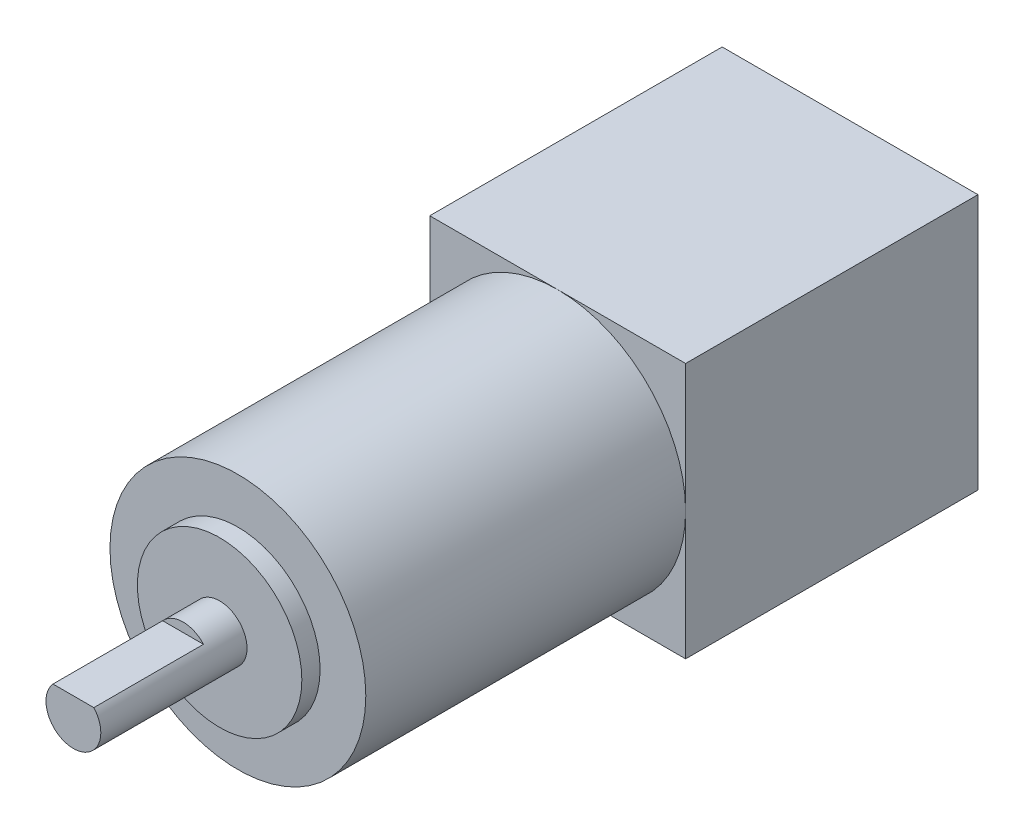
from build123d import *

# Parameters (mm, degrees)
SKETCH1_W           = 28
SKETCH1_H           = 28
BOSS_EXTRUDE1_DEPTH = 32
SKETCH2_R           = 14
BOSS_EXTRUDE2_DEPTH = 35
SKETCH3_R           = 9
BOSS_EXTRUDE3_DEPTH = 2
SKETCH4_R           = 3
BOSS_EXTRUDE4_DEPTH = 16
SKETCH5_OUTSIDE_W   = 48.754
SKETCH5_OUTSIDE_H   = 48.754
CUT_EXTRUDE1_DEPTH  = 12
SKETCH6_R           = 2.5
BOSS_EXTRUDE5_DEPTH = 10


with BuildPart() as part:
    # Sketch1 → Boss-Extrude1 (new body)
    with BuildSketch(Plane.XY):
        Rectangle(SKETCH1_W, SKETCH1_H)
    extrude(amount=BOSS_EXTRUDE1_DEPTH)

    # Sketch2 → Boss-Extrude2 (add)
    with BuildSketch(Plane.XY.offset(32)):
        Circle(SKETCH2_R)
    extrude(amount=BOSS_EXTRUDE2_DEPTH)

    # Sketch3 → Boss-Extrude3 (add)
    with BuildSketch(Plane.XY.offset(67)):
        Circle(SKETCH3_R)
    extrude(amount=BOSS_EXTRUDE3_DEPTH)

    # Sketch4 → Boss-Extrude4 (add)
    with BuildSketch(Plane.XY.offset(69)):
        Circle(SKETCH4_R)
    extrude(amount=BOSS_EXTRUDE4_DEPTH)

    # Sketch5 outside → Cut-Extrude1 (cut)
    with BuildSketch(Plane.XY.offset(85)):
        Rectangle(SKETCH5_OUTSIDE_W, SKETCH5_OUTSIDE_H)
        with BuildLine():
            Line((-2.236067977, 2), (2.236067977, 2))
            ThreePointArc((2.236067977, 2), (0, -3), (-2.236067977, 2))
        make_face(mode=Mode.SUBTRACT)
    extrude(amount=-CUT_EXTRUDE1_DEPTH, mode=Mode.SUBTRACT)

    # Sketch6 → Boss-Extrude5 (add)
    with BuildSketch(Plane(origin=(0, 0, 0), x_dir=(-1, 0, 0), z_dir=(0, 0, -1))):
        Circle(SKETCH6_R)
    extrude(amount=BOSS_EXTRUDE5_DEPTH)


solid = part.part
